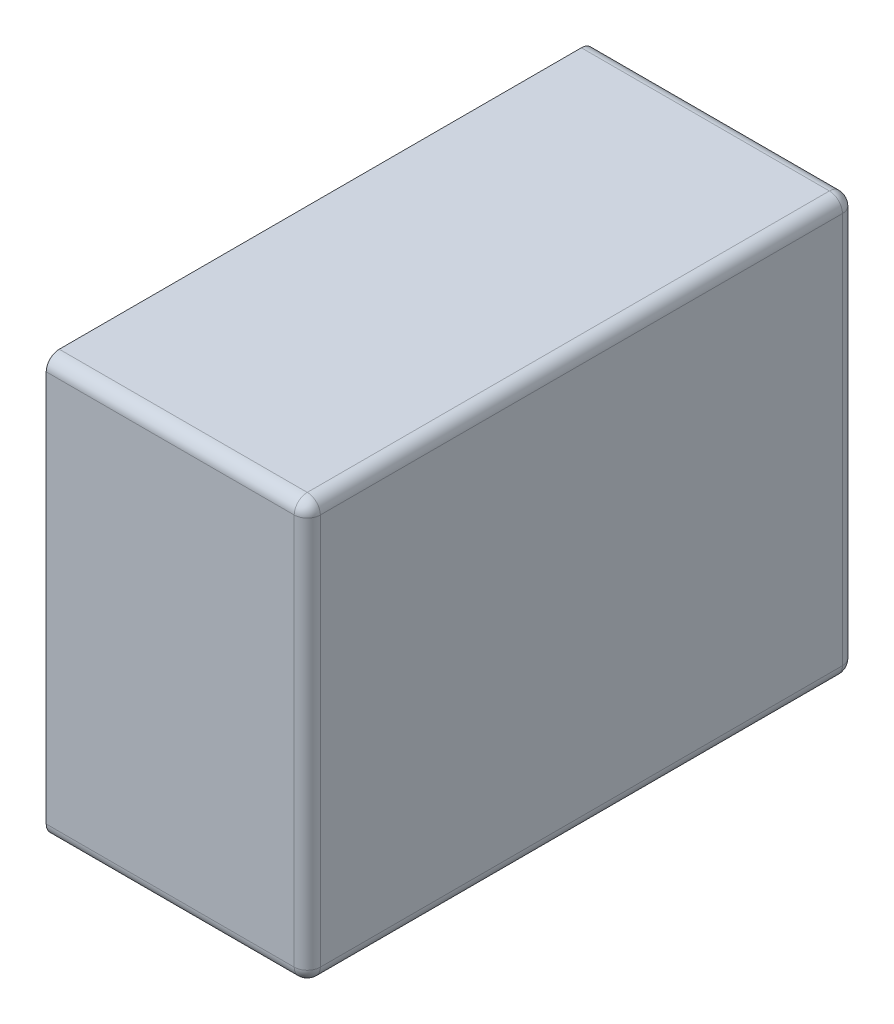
ISO-10303-21;
HEADER;
FILE_DESCRIPTION(('STEP AP214'),'2;1');
FILE_NAME('part.step','',(''),(''),'','','');
FILE_SCHEMA(('AUTOMOTIVE_DESIGN { 1 0 10303 214 1 1 1 1 }'));
ENDSEC;
DATA;
#1=APPLICATION_CONTEXT('core data for automotive mechanical design processes');
#2=APPLICATION_PROTOCOL_DEFINITION('international standard','automotive_design',2000,#1);
#3=PRODUCT_CONTEXT('',#1,'mechanical');
#4=PRODUCT('Part','Part','',(#3));
#5=PRODUCT_RELATED_PRODUCT_CATEGORY('part','',(#4));
#6=PRODUCT_DEFINITION_FORMATION('','',#4);
#7=PRODUCT_DEFINITION_CONTEXT('part definition',#1,'design');
#8=PRODUCT_DEFINITION('design','',#6,#7);
#9=PRODUCT_DEFINITION_SHAPE('','',#8);
#10=(LENGTH_UNIT() NAMED_UNIT(*) SI_UNIT(.MILLI.,.METRE.));
#11=(NAMED_UNIT(*) PLANE_ANGLE_UNIT() SI_UNIT($,.RADIAN.));
#12=(NAMED_UNIT(*) SI_UNIT($,.STERADIAN.) SOLID_ANGLE_UNIT());
#13=UNCERTAINTY_MEASURE_WITH_UNIT(LENGTH_MEASURE(1.E-05),#10,'distance_accuracy_value','');
#14=(GEOMETRIC_REPRESENTATION_CONTEXT(3) GLOBAL_UNCERTAINTY_ASSIGNED_CONTEXT((#13)) GLOBAL_UNIT_ASSIGNED_CONTEXT((#10,
#11,#12)) REPRESENTATION_CONTEXT('',''));
#15=CARTESIAN_POINT('',(0.,0.,0.));
#16=DIRECTION('',(0.,0.,1.));
#17=DIRECTION('',(1.,0.,0.));
#18=AXIS2_PLACEMENT_3D('',#15,#16,#17);
#19=CARTESIAN_POINT('',(0.,0.,0.));
#20=DIRECTION('',(1.,0.,0.));
#21=DIRECTION('',(0.,0.,-1.));
#22=AXIS2_PLACEMENT_3D('',#19,#20,#21);
#23=PLANE('',#22);
#24=DIRECTION('',(0.,0.,-1.));
#25=VECTOR('',#24,1.);
#26=CARTESIAN_POINT('',(0.,-48.,63.));
#27=LINE('',#26,#25);
#28=CARTESIAN_POINT('',(0.,-48.,60.));
#29=VERTEX_POINT('',#28);
#30=CARTESIAN_POINT('',(0.,-48.,-60.));
#31=VERTEX_POINT('',#30);
#32=EDGE_CURVE('E231',#29,#31,#27,.T.);
#33=ORIENTED_EDGE('',*,*,#32,.F.);
#34=CARTESIAN_POINT('',(0.,-45.,60.));
#35=DIRECTION('',(1.,0.,0.));
#36=DIRECTION('',(0.,0.,-1.));
#37=AXIS2_PLACEMENT_3D('',#34,#35,#36);
#38=CIRCLE('',#37,3.);
#39=CARTESIAN_POINT('',(0.,-45.,63.));
#40=VERTEX_POINT('',#39);
#41=EDGE_CURVE('E395',#29,#40,#38,.F.);
#42=ORIENTED_EDGE('',*,*,#41,.T.);
#43=DIRECTION('',(0.,-1.,0.));
#44=VECTOR('',#43,1.);
#45=CARTESIAN_POINT('',(0.,48.,63.));
#46=LINE('',#45,#44);
#47=CARTESIAN_POINT('',(0.,45.,63.));
#48=VERTEX_POINT('',#47);
#49=EDGE_CURVE('E281',#48,#40,#46,.T.);
#50=ORIENTED_EDGE('',*,*,#49,.F.);
#51=CARTESIAN_POINT('',(0.,45.,60.));
#52=DIRECTION('',(1.,0.,0.));
#53=DIRECTION('',(0.,0.,-1.));
#54=AXIS2_PLACEMENT_3D('',#51,#52,#53);
#55=CIRCLE('',#54,3.);
#56=CARTESIAN_POINT('',(0.,48.,60.));
#57=VERTEX_POINT('',#56);
#58=EDGE_CURVE('E393',#48,#57,#55,.F.);
#59=ORIENTED_EDGE('',*,*,#58,.T.);
#60=DIRECTION('',(0.,0.,1.));
#61=VECTOR('',#60,1.);
#62=CARTESIAN_POINT('',(0.,48.,63.));
#63=LINE('',#62,#61);
#64=CARTESIAN_POINT('',(0.,48.,-60.));
#65=VERTEX_POINT('',#64);
#66=EDGE_CURVE('E279',#65,#57,#63,.T.);
#67=ORIENTED_EDGE('',*,*,#66,.F.);
#68=CARTESIAN_POINT('',(0.,45.,-60.));
#69=DIRECTION('',(1.,0.,0.));
#70=DIRECTION('',(0.,0.,-1.));
#71=AXIS2_PLACEMENT_3D('',#68,#69,#70);
#72=CIRCLE('',#71,3.);
#73=CARTESIAN_POINT('',(0.,45.,-63.));
#74=VERTEX_POINT('',#73);
#75=EDGE_CURVE('E360',#65,#74,#72,.F.);
#76=ORIENTED_EDGE('',*,*,#75,.T.);
#77=DIRECTION('',(0.,1.,0.));
#78=VECTOR('',#77,1.);
#79=CARTESIAN_POINT('',(0.,48.,-63.));
#80=LINE('',#79,#78);
#81=CARTESIAN_POINT('',(0.,-45.,-63.));
#82=VERTEX_POINT('',#81);
#83=EDGE_CURVE('E266',#82,#74,#80,.T.);
#84=ORIENTED_EDGE('',*,*,#83,.F.);
#85=CARTESIAN_POINT('',(0.,-45.,-60.));
#86=DIRECTION('',(1.,0.,0.));
#87=DIRECTION('',(0.,0.,-1.));
#88=AXIS2_PLACEMENT_3D('',#85,#86,#87);
#89=CIRCLE('',#88,3.);
#90=EDGE_CURVE('E352',#82,#31,#89,.F.);
#91=ORIENTED_EDGE('',*,*,#90,.T.);
#92=EDGE_LOOP('',(#33,#42,#50,#59,#67,#76,#84,#91));
#93=FACE_BOUND('',#92,.T.);
#94=DIRECTION('',(0.,1.,0.));
#95=VECTOR('',#94,1.);
#96=CARTESIAN_POINT('',(0.,47.,62.));
#97=LINE('',#96,#95);
#98=CARTESIAN_POINT('',(0.,-41.,62.));
#99=VERTEX_POINT('',#98);
#100=CARTESIAN_POINT('',(0.,41.,62.));
#101=VERTEX_POINT('',#100);
#102=EDGE_CURVE('E267',#99,#101,#97,.T.);
#103=ORIENTED_EDGE('',*,*,#102,.F.);
#104=CARTESIAN_POINT('',(0.,-41.,56.));
#105=DIRECTION('',(1.,0.,0.));
#106=DIRECTION('',(0.,0.,-1.));
#107=AXIS2_PLACEMENT_3D('',#104,#105,#106);
#108=CIRCLE('',#107,6.);
#109=CARTESIAN_POINT('',(0.,-47.,56.));
#110=VERTEX_POINT('',#109);
#111=EDGE_CURVE('E294',#99,#110,#108,.T.);
#112=ORIENTED_EDGE('',*,*,#111,.T.);
#113=DIRECTION('',(0.,0.,1.));
#114=VECTOR('',#113,1.);
#115=CARTESIAN_POINT('',(0.,-47.,-62.));
#116=LINE('',#115,#114);
#117=CARTESIAN_POINT('',(0.,-47.,-56.));
#118=VERTEX_POINT('',#117);
#119=EDGE_CURVE('E258',#118,#110,#116,.T.);
#120=ORIENTED_EDGE('',*,*,#119,.F.);
#121=CARTESIAN_POINT('',(0.,-41.,-56.));
#122=DIRECTION('',(1.,0.,0.));
#123=DIRECTION('',(0.,0.,-1.));
#124=AXIS2_PLACEMENT_3D('',#121,#122,#123);
#125=CIRCLE('',#124,6.);
#126=CARTESIAN_POINT('',(0.,-41.,-62.));
#127=VERTEX_POINT('',#126);
#128=EDGE_CURVE('E348',#118,#127,#125,.T.);
#129=ORIENTED_EDGE('',*,*,#128,.T.);
#130=DIRECTION('',(0.,-1.,0.));
#131=VECTOR('',#130,1.);
#132=CARTESIAN_POINT('',(0.,47.,-62.));
#133=LINE('',#132,#131);
#134=CARTESIAN_POINT('',(0.,41.,-62.));
#135=VERTEX_POINT('',#134);
#136=EDGE_CURVE('E273',#135,#127,#133,.T.);
#137=ORIENTED_EDGE('',*,*,#136,.F.);
#138=CARTESIAN_POINT('',(0.,41.,-56.));
#139=DIRECTION('',(1.,0.,0.));
#140=DIRECTION('',(0.,0.,-1.));
#141=AXIS2_PLACEMENT_3D('',#138,#139,#140);
#142=CIRCLE('',#141,6.);
#143=CARTESIAN_POINT('',(0.,47.,-56.));
#144=VERTEX_POINT('',#143);
#145=EDGE_CURVE('E330',#135,#144,#142,.T.);
#146=ORIENTED_EDGE('',*,*,#145,.T.);
#147=DIRECTION('',(0.,0.,-1.));
#148=VECTOR('',#147,1.);
#149=CARTESIAN_POINT('',(0.,47.,-62.));
#150=LINE('',#149,#148);
#151=CARTESIAN_POINT('',(0.,47.,56.));
#152=VERTEX_POINT('',#151);
#153=EDGE_CURVE('E270',#152,#144,#150,.T.);
#154=ORIENTED_EDGE('',*,*,#153,.F.);
#155=CARTESIAN_POINT('',(0.,41.,56.));
#156=DIRECTION('',(1.,0.,0.));
#157=DIRECTION('',(0.,0.,-1.));
#158=AXIS2_PLACEMENT_3D('',#155,#156,#157);
#159=CIRCLE('',#158,6.);
#160=EDGE_CURVE('E312',#152,#101,#159,.T.);
#161=ORIENTED_EDGE('',*,*,#160,.T.);
#162=EDGE_LOOP('',(#103,#112,#120,#129,#137,#146,#154,#161));
#163=FACE_BOUND('',#162,.T.);
#164=ADVANCED_FACE('F35',(#93,#163),#23,.F.);
#165=CARTESIAN_POINT('',(60.,48.,-63.));
#166=DIRECTION('',(0.,0.,1.));
#167=DIRECTION('',(0.,-1.,0.));
#168=AXIS2_PLACEMENT_3D('',#165,#166,#167);
#169=PLANE('',#168);
#170=CARTESIAN_POINT('',(20.5,20.,-63.));
#171=DIRECTION('',(0.,0.,1.));
#172=DIRECTION('',(1.,0.,0.));
#173=AXIS2_PLACEMENT_3D('',#170,#171,#172);
#174=CIRCLE('',#173,6.);
#175=CARTESIAN_POINT('',(26.5,20.,-63.));
#176=VERTEX_POINT('',#175);
#177=EDGE_CURVE('E555',#176,#176,#174,.T.);
#178=ORIENTED_EDGE('',*,*,#177,.T.);
#179=EDGE_LOOP('',(#178));
#180=FACE_BOUND('',#179,.T.);
#181=CARTESIAN_POINT('',(20.5,0.,-63.));
#182=DIRECTION('',(0.,0.,1.));
#183=DIRECTION('',(1.,0.,0.));
#184=AXIS2_PLACEMENT_3D('',#181,#182,#183);
#185=CIRCLE('',#184,6.);
#186=CARTESIAN_POINT('',(26.5,0.,-63.));
#187=VERTEX_POINT('',#186);
#188=EDGE_CURVE('E563',#187,#187,#185,.T.);
#189=ORIENTED_EDGE('',*,*,#188,.T.);
#190=EDGE_LOOP('',(#189));
#191=FACE_BOUND('',#190,.T.);
#192=CARTESIAN_POINT('',(20.5,-20.,-63.));
#193=DIRECTION('',(0.,0.,1.));
#194=DIRECTION('',(1.,0.,0.));
#195=AXIS2_PLACEMENT_3D('',#192,#193,#194);
#196=CIRCLE('',#195,3.5);
#197=CARTESIAN_POINT('',(24.,-20.,-63.));
#198=VERTEX_POINT('',#197);
#199=EDGE_CURVE('E412',#198,#198,#196,.T.);
#200=ORIENTED_EDGE('',*,*,#199,.T.);
#201=EDGE_LOOP('',(#200));
#202=FACE_BOUND('',#201,.T.);
#203=DIRECTION('',(-1.,0.,0.));
#204=VECTOR('',#203,1.);
#205=CARTESIAN_POINT('',(60.,45.,-63.));
#206=LINE('',#205,#204);
#207=CARTESIAN_POINT('',(57.,45.,-63.));
#208=VERTEX_POINT('',#207);
#209=EDGE_CURVE('E362',#74,#208,#206,.F.);
#210=ORIENTED_EDGE('',*,*,#209,.T.);
#211=DIRECTION('',(0.,1.,0.));
#212=VECTOR('',#211,1.);
#213=CARTESIAN_POINT('',(57.,-45.,-63.));
#214=LINE('',#213,#212);
#215=CARTESIAN_POINT('',(57.,-45.,-63.));
#216=VERTEX_POINT('',#215);
#217=EDGE_CURVE('E376',#208,#216,#214,.F.);
#218=ORIENTED_EDGE('',*,*,#217,.T.);
#219=DIRECTION('',(-1.,0.,0.));
#220=VECTOR('',#219,1.);
#221=CARTESIAN_POINT('',(60.,-45.,-63.));
#222=LINE('',#221,#220);
#223=EDGE_CURVE('E350',#216,#82,#222,.T.);
#224=ORIENTED_EDGE('',*,*,#223,.T.);
#225=ORIENTED_EDGE('',*,*,#83,.T.);
#226=EDGE_LOOP('',(#210,#218,#224,#225));
#227=FACE_BOUND('',#226,.T.);
#228=ADVANCED_FACE('F474',(#180,#191,#202,#227),#169,.F.);
#229=CARTESIAN_POINT('',(60.,48.,63.));
#230=DIRECTION('',(0.,-1.,0.));
#231=DIRECTION('',(0.,0.,-1.));
#232=AXIS2_PLACEMENT_3D('',#229,#230,#231);
#233=PLANE('',#232);
#234=ORIENTED_EDGE('',*,*,#66,.T.);
#235=DIRECTION('',(-1.,0.,0.));
#236=VECTOR('',#235,1.);
#237=CARTESIAN_POINT('',(60.,48.,60.));
#238=LINE('',#237,#236);
#239=CARTESIAN_POINT('',(57.,48.,60.));
#240=VERTEX_POINT('',#239);
#241=EDGE_CURVE('E11',#57,#240,#238,.F.);
#242=ORIENTED_EDGE('',*,*,#241,.T.);
#243=DIRECTION('',(0.,0.,1.));
#244=VECTOR('',#243,1.);
#245=CARTESIAN_POINT('',(57.,48.,-60.));
#246=LINE('',#245,#244);
#247=CARTESIAN_POINT('',(57.,48.,-60.));
#248=VERTEX_POINT('',#247);
#249=EDGE_CURVE('E380',#240,#248,#246,.F.);
#250=ORIENTED_EDGE('',*,*,#249,.T.);
#251=DIRECTION('',(-1.,0.,0.));
#252=VECTOR('',#251,1.);
#253=CARTESIAN_POINT('',(60.,48.,-60.));
#254=LINE('',#253,#252);
#255=EDGE_CURVE('E358',#248,#65,#254,.T.);
#256=ORIENTED_EDGE('',*,*,#255,.T.);
#257=EDGE_LOOP('',(#234,#242,#250,#256));
#258=FACE_BOUND('',#257,.T.);
#259=ADVANCED_FACE('F478',(#258),#233,.F.);
#260=CARTESIAN_POINT('',(60.,48.,63.));
#261=DIRECTION('',(0.,0.,-1.));
#262=DIRECTION('',(0.,1.,0.));
#263=AXIS2_PLACEMENT_3D('',#260,#261,#262);
#264=PLANE('',#263);
#265=ORIENTED_EDGE('',*,*,#49,.T.);
#266=DIRECTION('',(-1.,0.,0.));
#267=VECTOR('',#266,1.);
#268=CARTESIAN_POINT('',(60.,-45.,63.));
#269=LINE('',#268,#267);
#270=CARTESIAN_POINT('',(57.,-45.,63.));
#271=VERTEX_POINT('',#270);
#272=EDGE_CURVE('E401',#40,#271,#269,.F.);
#273=ORIENTED_EDGE('',*,*,#272,.T.);
#274=DIRECTION('',(0.,-1.,0.));
#275=VECTOR('',#274,1.);
#276=CARTESIAN_POINT('',(57.,45.,63.));
#277=LINE('',#276,#275);
#278=CARTESIAN_POINT('',(57.,45.,63.));
#279=VERTEX_POINT('',#278);
#280=EDGE_CURVE('E399',#271,#279,#277,.F.);
#281=ORIENTED_EDGE('',*,*,#280,.T.);
#282=DIRECTION('',(-1.,0.,0.));
#283=VECTOR('',#282,1.);
#284=CARTESIAN_POINT('',(60.,45.,63.));
#285=LINE('',#284,#283);
#286=EDGE_CURVE('E397',#279,#48,#285,.T.);
#287=ORIENTED_EDGE('',*,*,#286,.T.);
#288=EDGE_LOOP('',(#265,#273,#281,#287));
#289=FACE_BOUND('',#288,.T.);
#290=ADVANCED_FACE('F429',(#289),#264,.F.);
#291=CARTESIAN_POINT('',(60.,-48.,63.));
#292=DIRECTION('',(0.,1.,0.));
#293=DIRECTION('',(0.,0.,1.));
#294=AXIS2_PLACEMENT_3D('',#291,#292,#293);
#295=PLANE('',#294);
#296=DIRECTION('',(0.,0.,-1.));
#297=VECTOR('',#296,1.);
#298=CARTESIAN_POINT('',(57.,-48.,63.));
#299=LINE('',#298,#297);
#300=CARTESIAN_POINT('',(57.,-48.,-60.));
#301=VERTEX_POINT('',#300);
#302=CARTESIAN_POINT('',(57.,-48.,60.));
#303=VERTEX_POINT('',#302);
#304=EDGE_CURVE('E371',#301,#303,#299,.F.);
#305=ORIENTED_EDGE('',*,*,#304,.T.);
#306=DIRECTION('',(-1.,0.,0.));
#307=VECTOR('',#306,1.);
#308=CARTESIAN_POINT('',(60.,-48.,60.));
#309=LINE('',#308,#307);
#310=EDGE_CURVE('E382',#303,#29,#309,.T.);
#311=ORIENTED_EDGE('',*,*,#310,.T.);
#312=ORIENTED_EDGE('',*,*,#32,.T.);
#313=DIRECTION('',(-1.,0.,0.));
#314=VECTOR('',#313,1.);
#315=CARTESIAN_POINT('',(60.,-48.,-60.));
#316=LINE('',#315,#314);
#317=EDGE_CURVE('E355',#31,#301,#316,.F.);
#318=ORIENTED_EDGE('',*,*,#317,.T.);
#319=EDGE_LOOP('',(#305,#311,#312,#318));
#320=FACE_BOUND('',#319,.T.);
#321=ADVANCED_FACE('F439',(#320),#295,.F.);
#322=CARTESIAN_POINT('',(60.,0.,0.));
#323=DIRECTION('',(1.,0.,0.));
#324=DIRECTION('',(0.,0.,-1.));
#325=AXIS2_PLACEMENT_3D('',#322,#323,#324);
#326=PLANE('',#325);
#327=DIRECTION('',(0.,0.,1.));
#328=VECTOR('',#327,1.);
#329=CARTESIAN_POINT('',(60.,45.,63.));
#330=LINE('',#329,#328);
#331=CARTESIAN_POINT('',(60.,45.,-60.));
#332=VERTEX_POINT('',#331);
#333=CARTESIAN_POINT('',(60.,45.,60.));
#334=VERTEX_POINT('',#333);
#335=EDGE_CURVE('E365',#332,#334,#330,.T.);
#336=ORIENTED_EDGE('',*,*,#335,.T.);
#337=DIRECTION('',(0.,-1.,0.));
#338=VECTOR('',#337,1.);
#339=CARTESIAN_POINT('',(60.,-45.,60.));
#340=LINE('',#339,#338);
#341=CARTESIAN_POINT('',(60.,-45.,60.));
#342=VERTEX_POINT('',#341);
#343=EDGE_CURVE('E405',#334,#342,#340,.T.);
#344=ORIENTED_EDGE('',*,*,#343,.T.);
#345=DIRECTION('',(0.,0.,-1.));
#346=VECTOR('',#345,1.);
#347=CARTESIAN_POINT('',(60.,-45.,-60.));
#348=LINE('',#347,#346);
#349=CARTESIAN_POINT('',(60.,-45.,-60.));
#350=VERTEX_POINT('',#349);
#351=EDGE_CURVE('E369',#342,#350,#348,.T.);
#352=ORIENTED_EDGE('',*,*,#351,.T.);
#353=DIRECTION('',(0.,1.,0.));
#354=VECTOR('',#353,1.);
#355=CARTESIAN_POINT('',(60.,45.,-60.));
#356=LINE('',#355,#354);
#357=EDGE_CURVE('E367',#350,#332,#356,.T.);
#358=ORIENTED_EDGE('',*,*,#357,.T.);
#359=EDGE_LOOP('',(#336,#344,#352,#358));
#360=FACE_BOUND('',#359,.T.);
#361=ADVANCED_FACE('F452',(#360),#326,.T.);
#362=CARTESIAN_POINT('',(-1.,47.,62.));
#363=DIRECTION('',(0.,0.,-1.));
#364=DIRECTION('',(-1.,0.,0.));
#365=AXIS2_PLACEMENT_3D('',#362,#363,#364);
#366=PLANE('',#365);
#367=ORIENTED_EDGE('',*,*,#102,.T.);
#368=DIRECTION('',(1.,0.,0.));
#369=VECTOR('',#368,1.);
#370=CARTESIAN_POINT('',(-1.,41.,62.));
#371=LINE('',#370,#369);
#372=CARTESIAN_POINT('',(-1.,41.,62.));
#373=VERTEX_POINT('',#372);
#374=EDGE_CURVE('E308',#101,#373,#371,.F.);
#375=ORIENTED_EDGE('',*,*,#374,.T.);
#376=DIRECTION('',(0.,1.,0.));
#377=VECTOR('',#376,1.);
#378=CARTESIAN_POINT('',(-1.,47.,62.));
#379=LINE('',#378,#377);
#380=CARTESIAN_POINT('',(-1.,-41.,62.));
#381=VERTEX_POINT('',#380);
#382=EDGE_CURVE('E254',#381,#373,#379,.T.);
#383=ORIENTED_EDGE('',*,*,#382,.F.);
#384=DIRECTION('',(1.,0.,0.));
#385=VECTOR('',#384,1.);
#386=CARTESIAN_POINT('',(-1.,-41.,62.));
#387=LINE('',#386,#385);
#388=EDGE_CURVE('E220',#381,#99,#387,.T.);
#389=ORIENTED_EDGE('',*,*,#388,.T.);
#390=EDGE_LOOP('',(#367,#375,#383,#389));
#391=FACE_BOUND('',#390,.T.);
#392=ADVANCED_FACE('F499',(#391),#366,.F.);
#393=CARTESIAN_POINT('',(-1.,47.,-62.));
#394=DIRECTION('',(0.,-1.,0.));
#395=DIRECTION('',(0.,0.,-1.));
#396=AXIS2_PLACEMENT_3D('',#393,#394,#395);
#397=PLANE('',#396);
#398=ORIENTED_EDGE('',*,*,#153,.T.);
#399=DIRECTION('',(1.,0.,0.));
#400=VECTOR('',#399,1.);
#401=CARTESIAN_POINT('',(-1.,47.,-56.));
#402=LINE('',#401,#400);
#403=CARTESIAN_POINT('',(-1.,47.,-56.));
#404=VERTEX_POINT('',#403);
#405=EDGE_CURVE('E326',#144,#404,#402,.F.);
#406=ORIENTED_EDGE('',*,*,#405,.T.);
#407=DIRECTION('',(0.,0.,-1.));
#408=VECTOR('',#407,1.);
#409=CARTESIAN_POINT('',(-1.,47.,-62.));
#410=LINE('',#409,#408);
#411=CARTESIAN_POINT('',(-1.,47.,56.));
#412=VERTEX_POINT('',#411);
#413=EDGE_CURVE('E257',#412,#404,#410,.T.);
#414=ORIENTED_EDGE('',*,*,#413,.F.);
#415=DIRECTION('',(1.,0.,0.));
#416=VECTOR('',#415,1.);
#417=CARTESIAN_POINT('',(-1.,47.,56.));
#418=LINE('',#417,#416);
#419=EDGE_CURVE('E305',#412,#152,#418,.T.);
#420=ORIENTED_EDGE('',*,*,#419,.T.);
#421=EDGE_LOOP('',(#398,#406,#414,#420));
#422=FACE_BOUND('',#421,.T.);
#423=ADVANCED_FACE('F503',(#422),#397,.F.);
#424=CARTESIAN_POINT('',(-1.,47.,-62.));
#425=DIRECTION('',(0.,0.,1.));
#426=DIRECTION('',(1.,0.,0.));
#427=AXIS2_PLACEMENT_3D('',#424,#425,#426);
#428=PLANE('',#427);
#429=ORIENTED_EDGE('',*,*,#136,.T.);
#430=DIRECTION('',(1.,0.,0.));
#431=VECTOR('',#430,1.);
#432=CARTESIAN_POINT('',(-1.,-41.,-62.));
#433=LINE('',#432,#431);
#434=CARTESIAN_POINT('',(-1.,-41.,-62.));
#435=VERTEX_POINT('',#434);
#436=EDGE_CURVE('E344',#127,#435,#433,.F.);
#437=ORIENTED_EDGE('',*,*,#436,.T.);
#438=DIRECTION('',(0.,-1.,0.));
#439=VECTOR('',#438,1.);
#440=CARTESIAN_POINT('',(-1.,47.,-62.));
#441=LINE('',#440,#439);
#442=CARTESIAN_POINT('',(-1.,41.,-62.));
#443=VERTEX_POINT('',#442);
#444=EDGE_CURVE('E261',#443,#435,#441,.T.);
#445=ORIENTED_EDGE('',*,*,#444,.F.);
#446=DIRECTION('',(1.,0.,0.));
#447=VECTOR('',#446,1.);
#448=CARTESIAN_POINT('',(-1.,41.,-62.));
#449=LINE('',#448,#447);
#450=EDGE_CURVE('E323',#443,#135,#449,.T.);
#451=ORIENTED_EDGE('',*,*,#450,.T.);
#452=EDGE_LOOP('',(#429,#437,#445,#451));
#453=FACE_BOUND('',#452,.T.);
#454=ADVANCED_FACE('F508',(#453),#428,.F.);
#455=CARTESIAN_POINT('',(-1.,-47.,-62.));
#456=DIRECTION('',(0.,1.,0.));
#457=DIRECTION('',(0.,0.,1.));
#458=AXIS2_PLACEMENT_3D('',#455,#456,#457);
#459=PLANE('',#458);
#460=DIRECTION('',(0.,0.,1.));
#461=VECTOR('',#460,1.);
#462=CARTESIAN_POINT('',(-1.,-47.,-62.));
#463=LINE('',#462,#461);
#464=CARTESIAN_POINT('',(-1.,-47.,-56.));
#465=VERTEX_POINT('',#464);
#466=CARTESIAN_POINT('',(-1.,-47.,56.));
#467=VERTEX_POINT('',#466);
#468=EDGE_CURVE('E264',#465,#467,#463,.T.);
#469=ORIENTED_EDGE('',*,*,#468,.F.);
#470=DIRECTION('',(1.,0.,0.));
#471=VECTOR('',#470,1.);
#472=CARTESIAN_POINT('',(-1.,-47.,-56.));
#473=LINE('',#472,#471);
#474=EDGE_CURVE('E341',#465,#118,#473,.T.);
#475=ORIENTED_EDGE('',*,*,#474,.T.);
#476=ORIENTED_EDGE('',*,*,#119,.T.);
#477=DIRECTION('',(1.,0.,0.));
#478=VECTOR('',#477,1.);
#479=CARTESIAN_POINT('',(-1.,-47.,56.));
#480=LINE('',#479,#478);
#481=EDGE_CURVE('E289',#110,#467,#480,.F.);
#482=ORIENTED_EDGE('',*,*,#481,.T.);
#483=EDGE_LOOP('',(#469,#475,#476,#482));
#484=FACE_BOUND('',#483,.T.);
#485=ADVANCED_FACE('F514',(#484),#459,.F.);
#486=CARTESIAN_POINT('',(-1.,0.,0.));
#487=DIRECTION('',(-1.,0.,0.));
#488=DIRECTION('',(0.,0.,1.));
#489=AXIS2_PLACEMENT_3D('',#486,#487,#488);
#490=PLANE('',#489);
#491=DIRECTION('',(0.,1.,0.));
#492=VECTOR('',#491,1.);
#493=CARTESIAN_POINT('',(-1.,46.,61.));
#494=LINE('',#493,#492);
#495=CARTESIAN_POINT('',(-1.,-40.,61.));
#496=VERTEX_POINT('',#495);
#497=CARTESIAN_POINT('',(-1.,40.,61.));
#498=VERTEX_POINT('',#497);
#499=EDGE_CURVE('E227',#496,#498,#494,.T.);
#500=ORIENTED_EDGE('',*,*,#499,.F.);
#501=CARTESIAN_POINT('',(-1.,-40.,55.));
#502=DIRECTION('',(-1.,0.,0.));
#503=DIRECTION('',(0.,0.,1.));
#504=AXIS2_PLACEMENT_3D('',#501,#502,#503);
#505=CIRCLE('',#504,6.);
#506=CARTESIAN_POINT('',(-1.,-46.,55.));
#507=VERTEX_POINT('',#506);
#508=EDGE_CURVE('E210',#496,#507,#505,.F.);
#509=ORIENTED_EDGE('',*,*,#508,.T.);
#510=DIRECTION('',(0.,0.,1.));
#511=VECTOR('',#510,1.);
#512=CARTESIAN_POINT('',(-1.,-46.,-61.));
#513=LINE('',#512,#511);
#514=CARTESIAN_POINT('',(-1.,-46.,-55.));
#515=VERTEX_POINT('',#514);
#516=EDGE_CURVE('E252',#515,#507,#513,.T.);
#517=ORIENTED_EDGE('',*,*,#516,.F.);
#518=CARTESIAN_POINT('',(-1.,-40.,-55.));
#519=DIRECTION('',(-1.,0.,0.));
#520=DIRECTION('',(0.,0.,1.));
#521=AXIS2_PLACEMENT_3D('',#518,#519,#520);
#522=CIRCLE('',#521,6.);
#523=CARTESIAN_POINT('',(-1.,-40.,-61.));
#524=VERTEX_POINT('',#523);
#525=EDGE_CURVE('E339',#515,#524,#522,.F.);
#526=ORIENTED_EDGE('',*,*,#525,.T.);
#527=DIRECTION('',(0.,-1.,0.));
#528=VECTOR('',#527,1.);
#529=CARTESIAN_POINT('',(-1.,46.,-61.));
#530=LINE('',#529,#528);
#531=CARTESIAN_POINT('',(-1.,40.,-61.));
#532=VERTEX_POINT('',#531);
#533=EDGE_CURVE('E241',#532,#524,#530,.T.);
#534=ORIENTED_EDGE('',*,*,#533,.F.);
#535=CARTESIAN_POINT('',(-1.,40.,-55.));
#536=DIRECTION('',(-1.,0.,0.));
#537=DIRECTION('',(0.,0.,1.));
#538=AXIS2_PLACEMENT_3D('',#535,#536,#537);
#539=CIRCLE('',#538,6.);
#540=CARTESIAN_POINT('',(-1.,46.,-55.));
#541=VERTEX_POINT('',#540);
#542=EDGE_CURVE('E321',#532,#541,#539,.F.);
#543=ORIENTED_EDGE('',*,*,#542,.T.);
#544=DIRECTION('',(0.,0.,-1.));
#545=VECTOR('',#544,1.);
#546=CARTESIAN_POINT('',(-1.,46.,-61.));
#547=LINE('',#546,#545);
#548=CARTESIAN_POINT('',(-1.,46.,55.));
#549=VERTEX_POINT('',#548);
#550=EDGE_CURVE('E237',#549,#541,#547,.T.);
#551=ORIENTED_EDGE('',*,*,#550,.F.);
#552=CARTESIAN_POINT('',(-1.,40.,55.));
#553=DIRECTION('',(-1.,0.,0.));
#554=DIRECTION('',(0.,0.,1.));
#555=AXIS2_PLACEMENT_3D('',#552,#553,#554);
#556=CIRCLE('',#555,6.);
#557=EDGE_CURVE('E236',#549,#498,#556,.F.);
#558=ORIENTED_EDGE('',*,*,#557,.T.);
#559=EDGE_LOOP('',(#500,#509,#517,#526,#534,#543,#551,#558));
#560=FACE_BOUND('',#559,.T.);
#561=ORIENTED_EDGE('',*,*,#444,.T.);
#562=CARTESIAN_POINT('',(-1.,-41.,-56.));
#563=DIRECTION('',(-1.,0.,0.));
#564=DIRECTION('',(0.,0.,1.));
#565=AXIS2_PLACEMENT_3D('',#562,#563,#564);
#566=CIRCLE('',#565,6.);
#567=EDGE_CURVE('E346',#435,#465,#566,.T.);
#568=ORIENTED_EDGE('',*,*,#567,.T.);
#569=ORIENTED_EDGE('',*,*,#468,.T.);
#570=CARTESIAN_POINT('',(-1.,-41.,56.));
#571=DIRECTION('',(-1.,0.,0.));
#572=DIRECTION('',(0.,0.,1.));
#573=AXIS2_PLACEMENT_3D('',#570,#571,#572);
#574=CIRCLE('',#573,6.);
#575=EDGE_CURVE('E292',#467,#381,#574,.T.);
#576=ORIENTED_EDGE('',*,*,#575,.T.);
#577=ORIENTED_EDGE('',*,*,#382,.T.);
#578=CARTESIAN_POINT('',(-1.,41.,56.));
#579=DIRECTION('',(-1.,0.,0.));
#580=DIRECTION('',(0.,0.,1.));
#581=AXIS2_PLACEMENT_3D('',#578,#579,#580);
#582=CIRCLE('',#581,6.);
#583=EDGE_CURVE('E310',#373,#412,#582,.T.);
#584=ORIENTED_EDGE('',*,*,#583,.T.);
#585=ORIENTED_EDGE('',*,*,#413,.T.);
#586=CARTESIAN_POINT('',(-1.,41.,-56.));
#587=DIRECTION('',(-1.,0.,0.));
#588=DIRECTION('',(0.,0.,1.));
#589=AXIS2_PLACEMENT_3D('',#586,#587,#588);
#590=CIRCLE('',#589,6.);
#591=EDGE_CURVE('E328',#404,#443,#590,.T.);
#592=ORIENTED_EDGE('',*,*,#591,.T.);
#593=EDGE_LOOP('',(#561,#568,#569,#576,#577,#584,#585,#592));
#594=FACE_BOUND('',#593,.T.);
#595=ADVANCED_FACE('F233',(#560,#594),#490,.T.);
#596=CARTESIAN_POINT('',(54.,46.,61.));
#597=DIRECTION('',(0.,0.,1.));
#598=DIRECTION('',(1.,0.,0.));
#599=AXIS2_PLACEMENT_3D('',#596,#597,#598);
#600=PLANE('',#599);
#601=ORIENTED_EDGE('',*,*,#499,.T.);
#602=DIRECTION('',(-1.,0.,0.));
#603=VECTOR('',#602,1.);
#604=CARTESIAN_POINT('',(54.,40.,61.));
#605=LINE('',#604,#603);
#606=CARTESIAN_POINT('',(54.,40.,61.));
#607=VERTEX_POINT('',#606);
#608=EDGE_CURVE('E300',#498,#607,#605,.F.);
#609=ORIENTED_EDGE('',*,*,#608,.T.);
#610=DIRECTION('',(0.,1.,0.));
#611=VECTOR('',#610,1.);
#612=CARTESIAN_POINT('',(54.,46.,61.));
#613=LINE('',#612,#611);
#614=CARTESIAN_POINT('',(54.,-40.,61.));
#615=VERTEX_POINT('',#614);
#616=EDGE_CURVE('E230',#615,#607,#613,.T.);
#617=ORIENTED_EDGE('',*,*,#616,.F.);
#618=DIRECTION('',(-1.,0.,0.));
#619=VECTOR('',#618,1.);
#620=CARTESIAN_POINT('',(-1.,-40.,61.));
#621=LINE('',#620,#619);
#622=EDGE_CURVE('E214',#615,#496,#621,.T.);
#623=ORIENTED_EDGE('',*,*,#622,.T.);
#624=EDGE_LOOP('',(#601,#609,#617,#623));
#625=FACE_BOUND('',#624,.T.);
#626=ADVANCED_FACE('F226',(#625),#600,.F.);
#627=CARTESIAN_POINT('',(54.,-46.,-61.));
#628=DIRECTION('',(0.,-1.,0.));
#629=DIRECTION('',(0.,0.,-1.));
#630=AXIS2_PLACEMENT_3D('',#627,#628,#629);
#631=PLANE('',#630);
#632=DIRECTION('',(0.,0.,1.));
#633=VECTOR('',#632,1.);
#634=CARTESIAN_POINT('',(54.,-46.,-61.));
#635=LINE('',#634,#633);
#636=CARTESIAN_POINT('',(54.,-46.,-55.));
#637=VERTEX_POINT('',#636);
#638=CARTESIAN_POINT('',(54.,-46.,55.));
#639=VERTEX_POINT('',#638);
#640=EDGE_CURVE('E247',#637,#639,#635,.T.);
#641=ORIENTED_EDGE('',*,*,#640,.F.);
#642=DIRECTION('',(-1.,0.,0.));
#643=VECTOR('',#642,1.);
#644=CARTESIAN_POINT('',(-1.,-46.,-55.));
#645=LINE('',#644,#643);
#646=EDGE_CURVE('E332',#637,#515,#645,.T.);
#647=ORIENTED_EDGE('',*,*,#646,.T.);
#648=ORIENTED_EDGE('',*,*,#516,.T.);
#649=DIRECTION('',(-1.,0.,0.));
#650=VECTOR('',#649,1.);
#651=CARTESIAN_POINT('',(54.,-46.,55.));
#652=LINE('',#651,#650);
#653=EDGE_CURVE('E216',#507,#639,#652,.F.);
#654=ORIENTED_EDGE('',*,*,#653,.T.);
#655=EDGE_LOOP('',(#641,#647,#648,#654));
#656=FACE_BOUND('',#655,.T.);
#657=ADVANCED_FACE('F523',(#656),#631,.F.);
#658=CARTESIAN_POINT('',(54.,46.,-61.));
#659=DIRECTION('',(0.,0.,-1.));
#660=DIRECTION('',(-1.,0.,0.));
#661=AXIS2_PLACEMENT_3D('',#658,#659,#660);
#662=PLANE('',#661);
#663=CARTESIAN_POINT('',(20.5,20.,-61.));
#664=DIRECTION('',(0.,0.,1.));
#665=DIRECTION('',(1.,0.,0.));
#666=AXIS2_PLACEMENT_3D('',#663,#664,#665);
#667=CIRCLE('',#666,6.);
#668=CARTESIAN_POINT('',(26.5,20.,-61.));
#669=VERTEX_POINT('',#668);
#670=EDGE_CURVE('E558',#669,#669,#667,.T.);
#671=ORIENTED_EDGE('',*,*,#670,.F.);
#672=EDGE_LOOP('',(#671));
#673=FACE_BOUND('',#672,.T.);
#674=CARTESIAN_POINT('',(20.5,0.,-61.));
#675=DIRECTION('',(0.,0.,1.));
#676=DIRECTION('',(1.,0.,0.));
#677=AXIS2_PLACEMENT_3D('',#674,#675,#676);
#678=CIRCLE('',#677,6.);
#679=CARTESIAN_POINT('',(26.5,0.,-61.));
#680=VERTEX_POINT('',#679);
#681=EDGE_CURVE('E560',#680,#680,#678,.T.);
#682=ORIENTED_EDGE('',*,*,#681,.F.);
#683=EDGE_LOOP('',(#682));
#684=FACE_BOUND('',#683,.T.);
#685=CARTESIAN_POINT('',(20.5,-20.,-61.));
#686=DIRECTION('',(0.,0.,1.));
#687=DIRECTION('',(1.,0.,0.));
#688=AXIS2_PLACEMENT_3D('',#685,#686,#687);
#689=CIRCLE('',#688,3.5);
#690=CARTESIAN_POINT('',(24.,-20.,-61.));
#691=VERTEX_POINT('',#690);
#692=EDGE_CURVE('E566',#691,#691,#689,.T.);
#693=ORIENTED_EDGE('',*,*,#692,.F.);
#694=EDGE_LOOP('',(#693));
#695=FACE_BOUND('',#694,.T.);
#696=ORIENTED_EDGE('',*,*,#533,.T.);
#697=DIRECTION('',(-1.,0.,0.));
#698=VECTOR('',#697,1.);
#699=CARTESIAN_POINT('',(54.,-40.,-61.));
#700=LINE('',#699,#698);
#701=CARTESIAN_POINT('',(54.,-40.,-61.));
#702=VERTEX_POINT('',#701);
#703=EDGE_CURVE('E335',#524,#702,#700,.F.);
#704=ORIENTED_EDGE('',*,*,#703,.T.);
#705=DIRECTION('',(0.,-1.,0.));
#706=VECTOR('',#705,1.);
#707=CARTESIAN_POINT('',(54.,46.,-61.));
#708=LINE('',#707,#706);
#709=CARTESIAN_POINT('',(54.,40.,-61.));
#710=VERTEX_POINT('',#709);
#711=EDGE_CURVE('E576',#710,#702,#708,.T.);
#712=ORIENTED_EDGE('',*,*,#711,.F.);
#713=DIRECTION('',(-1.,0.,0.));
#714=VECTOR('',#713,1.);
#715=CARTESIAN_POINT('',(-1.,40.,-61.));
#716=LINE('',#715,#714);
#717=EDGE_CURVE('E314',#710,#532,#716,.T.);
#718=ORIENTED_EDGE('',*,*,#717,.T.);
#719=EDGE_LOOP('',(#696,#704,#712,#718));
#720=FACE_BOUND('',#719,.T.);
#721=ADVANCED_FACE('F528',(#673,#684,#695,#720),#662,.F.);
#722=CARTESIAN_POINT('',(54.,46.,-61.));
#723=DIRECTION('',(0.,1.,0.));
#724=DIRECTION('',(0.,0.,1.));
#725=AXIS2_PLACEMENT_3D('',#722,#723,#724);
#726=PLANE('',#725);
#727=ORIENTED_EDGE('',*,*,#550,.T.);
#728=DIRECTION('',(-1.,0.,0.));
#729=VECTOR('',#728,1.);
#730=CARTESIAN_POINT('',(54.,46.,-55.));
#731=LINE('',#730,#729);
#732=CARTESIAN_POINT('',(54.,46.,-55.));
#733=VERTEX_POINT('',#732);
#734=EDGE_CURVE('E317',#541,#733,#731,.F.);
#735=ORIENTED_EDGE('',*,*,#734,.T.);
#736=DIRECTION('',(0.,0.,-1.));
#737=VECTOR('',#736,1.);
#738=CARTESIAN_POINT('',(54.,46.,-61.));
#739=LINE('',#738,#737);
#740=CARTESIAN_POINT('',(54.,46.,55.));
#741=VERTEX_POINT('',#740);
#742=EDGE_CURVE('E574',#741,#733,#739,.T.);
#743=ORIENTED_EDGE('',*,*,#742,.F.);
#744=DIRECTION('',(-1.,0.,0.));
#745=VECTOR('',#744,1.);
#746=CARTESIAN_POINT('',(-1.,46.,55.));
#747=LINE('',#746,#745);
#748=EDGE_CURVE('E297',#741,#549,#747,.T.);
#749=ORIENTED_EDGE('',*,*,#748,.T.);
#750=EDGE_LOOP('',(#727,#735,#743,#749));
#751=FACE_BOUND('',#750,.T.);
#752=ADVANCED_FACE('F524',(#751),#726,.F.);
#753=CARTESIAN_POINT('',(54.,0.,0.));
#754=DIRECTION('',(-1.,0.,0.));
#755=DIRECTION('',(0.,0.,1.));
#756=AXIS2_PLACEMENT_3D('',#753,#754,#755);
#757=PLANE('',#756);
#758=ORIENTED_EDGE('',*,*,#711,.T.);
#759=CARTESIAN_POINT('',(54.,-40.,-55.));
#760=DIRECTION('',(-1.,0.,0.));
#761=DIRECTION('',(0.,0.,1.));
#762=AXIS2_PLACEMENT_3D('',#759,#760,#761);
#763=CIRCLE('',#762,6.);
#764=EDGE_CURVE('E337',#702,#637,#763,.T.);
#765=ORIENTED_EDGE('',*,*,#764,.T.);
#766=ORIENTED_EDGE('',*,*,#640,.T.);
#767=CARTESIAN_POINT('',(54.,-40.,55.));
#768=DIRECTION('',(-1.,0.,0.));
#769=DIRECTION('',(0.,0.,1.));
#770=AXIS2_PLACEMENT_3D('',#767,#768,#769);
#771=CIRCLE('',#770,6.);
#772=EDGE_CURVE('E221',#639,#615,#771,.T.);
#773=ORIENTED_EDGE('',*,*,#772,.T.);
#774=ORIENTED_EDGE('',*,*,#616,.T.);
#775=CARTESIAN_POINT('',(54.,40.,55.));
#776=DIRECTION('',(-1.,0.,0.));
#777=DIRECTION('',(0.,0.,1.));
#778=AXIS2_PLACEMENT_3D('',#775,#776,#777);
#779=CIRCLE('',#778,6.);
#780=EDGE_CURVE('E302',#607,#741,#779,.T.);
#781=ORIENTED_EDGE('',*,*,#780,.T.);
#782=ORIENTED_EDGE('',*,*,#742,.T.);
#783=CARTESIAN_POINT('',(54.,40.,-55.));
#784=DIRECTION('',(-1.,0.,0.));
#785=DIRECTION('',(0.,0.,1.));
#786=AXIS2_PLACEMENT_3D('',#783,#784,#785);
#787=CIRCLE('',#786,6.);
#788=EDGE_CURVE('E319',#733,#710,#787,.T.);
#789=ORIENTED_EDGE('',*,*,#788,.T.);
#790=EDGE_LOOP('',(#758,#765,#766,#773,#774,#781,#782,#789));
#791=FACE_BOUND('',#790,.T.);
#792=ADVANCED_FACE('F527',(#791),#757,.T.);
#793=CARTESIAN_POINT('',(54.,-40.,55.));
#794=DIRECTION('',(1.,0.,0.));
#795=DIRECTION('',(0.,0.,-1.));
#796=AXIS2_PLACEMENT_3D('',#793,#794,#795);
#797=CYLINDRICAL_SURFACE('',#796,6.);
#798=ORIENTED_EDGE('',*,*,#772,.F.);
#799=ORIENTED_EDGE('',*,*,#653,.F.);
#800=ORIENTED_EDGE('',*,*,#508,.F.);
#801=ORIENTED_EDGE('',*,*,#622,.F.);
#802=EDGE_LOOP('',(#798,#799,#800,#801));
#803=FACE_BOUND('',#802,.T.);
#804=ADVANCED_FACE('F213',(#803),#797,.F.);
#805=CARTESIAN_POINT('',(-1.,-41.,56.));
#806=DIRECTION('',(1.,0.,0.));
#807=DIRECTION('',(0.,0.,-1.));
#808=AXIS2_PLACEMENT_3D('',#805,#806,#807);
#809=CYLINDRICAL_SURFACE('',#808,6.);
#810=ORIENTED_EDGE('',*,*,#575,.F.);
#811=ORIENTED_EDGE('',*,*,#481,.F.);
#812=ORIENTED_EDGE('',*,*,#111,.F.);
#813=ORIENTED_EDGE('',*,*,#388,.F.);
#814=EDGE_LOOP('',(#810,#811,#812,#813));
#815=FACE_BOUND('',#814,.T.);
#816=ADVANCED_FACE('F751',(#815),#809,.T.);
#817=CARTESIAN_POINT('',(54.,40.,55.));
#818=DIRECTION('',(1.,0.,0.));
#819=DIRECTION('',(0.,0.,-1.));
#820=AXIS2_PLACEMENT_3D('',#817,#818,#819);
#821=CYLINDRICAL_SURFACE('',#820,6.);
#822=ORIENTED_EDGE('',*,*,#780,.F.);
#823=ORIENTED_EDGE('',*,*,#608,.F.);
#824=ORIENTED_EDGE('',*,*,#557,.F.);
#825=ORIENTED_EDGE('',*,*,#748,.F.);
#826=EDGE_LOOP('',(#822,#823,#824,#825));
#827=FACE_BOUND('',#826,.T.);
#828=ADVANCED_FACE('F736',(#827),#821,.F.);
#829=CARTESIAN_POINT('',(-1.,41.,56.));
#830=DIRECTION('',(1.,0.,0.));
#831=DIRECTION('',(0.,0.,-1.));
#832=AXIS2_PLACEMENT_3D('',#829,#830,#831);
#833=CYLINDRICAL_SURFACE('',#832,6.);
#834=ORIENTED_EDGE('',*,*,#583,.F.);
#835=ORIENTED_EDGE('',*,*,#374,.F.);
#836=ORIENTED_EDGE('',*,*,#160,.F.);
#837=ORIENTED_EDGE('',*,*,#419,.F.);
#838=EDGE_LOOP('',(#834,#835,#836,#837));
#839=FACE_BOUND('',#838,.T.);
#840=ADVANCED_FACE('F723',(#839),#833,.T.);
#841=CARTESIAN_POINT('',(54.,40.,-55.));
#842=DIRECTION('',(1.,0.,0.));
#843=DIRECTION('',(0.,0.,-1.));
#844=AXIS2_PLACEMENT_3D('',#841,#842,#843);
#845=CYLINDRICAL_SURFACE('',#844,6.);
#846=ORIENTED_EDGE('',*,*,#788,.F.);
#847=ORIENTED_EDGE('',*,*,#734,.F.);
#848=ORIENTED_EDGE('',*,*,#542,.F.);
#849=ORIENTED_EDGE('',*,*,#717,.F.);
#850=EDGE_LOOP('',(#846,#847,#848,#849));
#851=FACE_BOUND('',#850,.T.);
#852=ADVANCED_FACE('F599',(#851),#845,.F.);
#853=CARTESIAN_POINT('',(-1.,41.,-56.));
#854=DIRECTION('',(1.,0.,0.));
#855=DIRECTION('',(0.,0.,-1.));
#856=AXIS2_PLACEMENT_3D('',#853,#854,#855);
#857=CYLINDRICAL_SURFACE('',#856,6.);
#858=ORIENTED_EDGE('',*,*,#591,.F.);
#859=ORIENTED_EDGE('',*,*,#405,.F.);
#860=ORIENTED_EDGE('',*,*,#145,.F.);
#861=ORIENTED_EDGE('',*,*,#450,.F.);
#862=EDGE_LOOP('',(#858,#859,#860,#861));
#863=FACE_BOUND('',#862,.T.);
#864=ADVANCED_FACE('F590',(#863),#857,.T.);
#865=CARTESIAN_POINT('',(54.,-40.,-55.));
#866=DIRECTION('',(1.,0.,0.));
#867=DIRECTION('',(0.,0.,-1.));
#868=AXIS2_PLACEMENT_3D('',#865,#866,#867);
#869=CYLINDRICAL_SURFACE('',#868,6.);
#870=ORIENTED_EDGE('',*,*,#764,.F.);
#871=ORIENTED_EDGE('',*,*,#703,.F.);
#872=ORIENTED_EDGE('',*,*,#525,.F.);
#873=ORIENTED_EDGE('',*,*,#646,.F.);
#874=EDGE_LOOP('',(#870,#871,#872,#873));
#875=FACE_BOUND('',#874,.T.);
#876=ADVANCED_FACE('F587',(#875),#869,.F.);
#877=CARTESIAN_POINT('',(-1.,-41.,-56.));
#878=DIRECTION('',(1.,0.,0.));
#879=DIRECTION('',(0.,0.,-1.));
#880=AXIS2_PLACEMENT_3D('',#877,#878,#879);
#881=CYLINDRICAL_SURFACE('',#880,6.);
#882=ORIENTED_EDGE('',*,*,#567,.F.);
#883=ORIENTED_EDGE('',*,*,#436,.F.);
#884=ORIENTED_EDGE('',*,*,#128,.F.);
#885=ORIENTED_EDGE('',*,*,#474,.F.);
#886=EDGE_LOOP('',(#882,#883,#884,#885));
#887=FACE_BOUND('',#886,.T.);
#888=ADVANCED_FACE('F589',(#887),#881,.T.);
#889=CARTESIAN_POINT('',(60.,-45.,-60.));
#890=DIRECTION('',(-1.,0.,0.));
#891=DIRECTION('',(0.,0.,1.));
#892=AXIS2_PLACEMENT_3D('',#889,#890,#891);
#893=CYLINDRICAL_SURFACE('',#892,3.);
#894=ORIENTED_EDGE('',*,*,#223,.F.);
#895=CARTESIAN_POINT('',(57.,-45.,-60.));
#896=DIRECTION('',(-1.,0.,0.));
#897=DIRECTION('',(0.,0.,1.));
#898=AXIS2_PLACEMENT_3D('',#895,#896,#897);
#899=CIRCLE('',#898,3.);
#900=EDGE_CURVE('E374',#216,#301,#899,.T.);
#901=ORIENTED_EDGE('',*,*,#900,.T.);
#902=ORIENTED_EDGE('',*,*,#317,.F.);
#903=ORIENTED_EDGE('',*,*,#90,.F.);
#904=EDGE_LOOP('',(#894,#901,#902,#903));
#905=FACE_BOUND('',#904,.T.);
#906=ADVANCED_FACE('F596',(#905),#893,.T.);
#907=CARTESIAN_POINT('',(60.,45.,-60.));
#908=DIRECTION('',(-1.,0.,0.));
#909=DIRECTION('',(0.,0.,1.));
#910=AXIS2_PLACEMENT_3D('',#907,#908,#909);
#911=CYLINDRICAL_SURFACE('',#910,3.);
#912=ORIENTED_EDGE('',*,*,#255,.F.);
#913=CARTESIAN_POINT('',(57.,45.,-60.));
#914=DIRECTION('',(-1.,0.,0.));
#915=DIRECTION('',(0.,0.,1.));
#916=AXIS2_PLACEMENT_3D('',#913,#914,#915);
#917=CIRCLE('',#916,3.);
#918=EDGE_CURVE('E378',#248,#208,#917,.T.);
#919=ORIENTED_EDGE('',*,*,#918,.T.);
#920=ORIENTED_EDGE('',*,*,#209,.F.);
#921=ORIENTED_EDGE('',*,*,#75,.F.);
#922=EDGE_LOOP('',(#912,#919,#920,#921));
#923=FACE_BOUND('',#922,.T.);
#924=ADVANCED_FACE('F471',(#923),#911,.T.);
#925=CARTESIAN_POINT('',(57.,45.,0.));
#926=DIRECTION('',(0.,0.,-1.));
#927=DIRECTION('',(-1.,0.,0.));
#928=AXIS2_PLACEMENT_3D('',#925,#926,#927);
#929=CYLINDRICAL_SURFACE('',#928,3.);
#930=ORIENTED_EDGE('',*,*,#249,.F.);
#931=CARTESIAN_POINT('',(57.,45.,60.));
#932=DIRECTION('',(0.,0.,-1.));
#933=DIRECTION('',(-1.,0.,0.));
#934=AXIS2_PLACEMENT_3D('',#931,#932,#933);
#935=CIRCLE('',#934,3.);
#936=EDGE_CURVE('E44',#240,#334,#935,.T.);
#937=ORIENTED_EDGE('',*,*,#936,.T.);
#938=ORIENTED_EDGE('',*,*,#335,.F.);
#939=CARTESIAN_POINT('',(57.,45.,-60.));
#940=DIRECTION('',(0.,0.,-1.));
#941=DIRECTION('',(-1.,0.,0.));
#942=AXIS2_PLACEMENT_3D('',#939,#940,#941);
#943=CIRCLE('',#942,3.);
#944=EDGE_CURVE('E238',#248,#332,#943,.T.);
#945=ORIENTED_EDGE('',*,*,#944,.F.);
#946=EDGE_LOOP('',(#930,#937,#938,#945));
#947=FACE_BOUND('',#946,.T.);
#948=ADVANCED_FACE('F464',(#947),#929,.T.);
#949=CARTESIAN_POINT('',(57.,45.,-60.));
#950=DIRECTION('',(0.,0.,1.));
#951=DIRECTION('',(1.,0.,0.));
#952=AXIS2_PLACEMENT_3D('',#949,#950,#951);
#953=SPHERICAL_SURFACE('',#952,3.);
#954=ORIENTED_EDGE('',*,*,#918,.F.);
#955=ORIENTED_EDGE('',*,*,#944,.T.);
#956=CARTESIAN_POINT('',(57.,45.,-60.));
#957=DIRECTION('',(0.,-1.,0.));
#958=DIRECTION('',(0.,0.,-1.));
#959=AXIS2_PLACEMENT_3D('',#956,#957,#958);
#960=CIRCLE('',#959,3.);
#961=EDGE_CURVE('E244',#208,#332,#960,.T.);
#962=ORIENTED_EDGE('',*,*,#961,.F.);
#963=EDGE_LOOP('',(#954,#955,#962));
#964=FACE_BOUND('',#963,.T.);
#965=ADVANCED_FACE('F467',(#964),#953,.T.);
#966=CARTESIAN_POINT('',(57.,0.,-60.));
#967=DIRECTION('',(0.,-1.,0.));
#968=DIRECTION('',(0.,0.,-1.));
#969=AXIS2_PLACEMENT_3D('',#966,#967,#968);
#970=CYLINDRICAL_SURFACE('',#969,3.);
#971=CARTESIAN_POINT('',(57.,-45.,-60.));
#972=DIRECTION('',(0.,-1.,0.));
#973=DIRECTION('',(0.,0.,-1.));
#974=AXIS2_PLACEMENT_3D('',#971,#972,#973);
#975=CIRCLE('',#974,3.);
#976=EDGE_CURVE('E386',#216,#350,#975,.T.);
#977=ORIENTED_EDGE('',*,*,#976,.F.);
#978=ORIENTED_EDGE('',*,*,#217,.F.);
#979=ORIENTED_EDGE('',*,*,#961,.T.);
#980=ORIENTED_EDGE('',*,*,#357,.F.);
#981=EDGE_LOOP('',(#977,#978,#979,#980));
#982=FACE_BOUND('',#981,.T.);
#983=ADVANCED_FACE('F461',(#982),#970,.T.);
#984=CARTESIAN_POINT('',(57.,-45.,-60.));
#985=DIRECTION('',(0.,0.,1.));
#986=DIRECTION('',(1.,0.,0.));
#987=AXIS2_PLACEMENT_3D('',#984,#985,#986);
#988=SPHERICAL_SURFACE('',#987,3.);
#989=ORIENTED_EDGE('',*,*,#900,.F.);
#990=ORIENTED_EDGE('',*,*,#976,.T.);
#991=CARTESIAN_POINT('',(57.,-45.,-60.));
#992=DIRECTION('',(0.,0.,1.));
#993=DIRECTION('',(1.,0.,0.));
#994=AXIS2_PLACEMENT_3D('',#991,#992,#993);
#995=CIRCLE('',#994,3.);
#996=EDGE_CURVE('E383',#301,#350,#995,.T.);
#997=ORIENTED_EDGE('',*,*,#996,.F.);
#998=EDGE_LOOP('',(#989,#990,#997));
#999=FACE_BOUND('',#998,.T.);
#1000=ADVANCED_FACE('F458',(#999),#988,.T.);
#1001=CARTESIAN_POINT('',(57.,-45.,0.));
#1002=DIRECTION('',(0.,0.,1.));
#1003=DIRECTION('',(1.,0.,0.));
#1004=AXIS2_PLACEMENT_3D('',#1001,#1002,#1003);
#1005=CYLINDRICAL_SURFACE('',#1004,3.);
#1006=ORIENTED_EDGE('',*,*,#351,.F.);
#1007=CARTESIAN_POINT('',(57.,-45.,60.));
#1008=DIRECTION('',(0.,0.,1.));
#1009=DIRECTION('',(1.,0.,0.));
#1010=AXIS2_PLACEMENT_3D('',#1007,#1008,#1009);
#1011=CIRCLE('',#1010,3.);
#1012=EDGE_CURVE('E403',#342,#303,#1011,.F.);
#1013=ORIENTED_EDGE('',*,*,#1012,.T.);
#1014=ORIENTED_EDGE('',*,*,#304,.F.);
#1015=ORIENTED_EDGE('',*,*,#996,.T.);
#1016=EDGE_LOOP('',(#1006,#1013,#1014,#1015));
#1017=FACE_BOUND('',#1016,.T.);
#1018=ADVANCED_FACE('F453',(#1017),#1005,.T.);
#1019=CARTESIAN_POINT('',(60.,45.,60.));
#1020=DIRECTION('',(-1.,0.,0.));
#1021=DIRECTION('',(0.,0.,1.));
#1022=AXIS2_PLACEMENT_3D('',#1019,#1020,#1021);
#1023=CYLINDRICAL_SURFACE('',#1022,3.);
#1024=CARTESIAN_POINT('',(57.,45.,60.));
#1025=DIRECTION('',(1.,0.,0.));
#1026=DIRECTION('',(0.,0.,-1.));
#1027=AXIS2_PLACEMENT_3D('',#1024,#1025,#1026);
#1028=CIRCLE('',#1027,3.);
#1029=EDGE_CURVE('E39',#240,#279,#1028,.T.);
#1030=ORIENTED_EDGE('',*,*,#1029,.F.);
#1031=ORIENTED_EDGE('',*,*,#241,.F.);
#1032=ORIENTED_EDGE('',*,*,#58,.F.);
#1033=ORIENTED_EDGE('',*,*,#286,.F.);
#1034=EDGE_LOOP('',(#1030,#1031,#1032,#1033));
#1035=FACE_BOUND('',#1034,.T.);
#1036=ADVANCED_FACE('F37',(#1035),#1023,.T.);
#1037=CARTESIAN_POINT('',(57.,45.,60.));
#1038=DIRECTION('',(0.,0.,1.));
#1039=DIRECTION('',(1.,0.,0.));
#1040=AXIS2_PLACEMENT_3D('',#1037,#1038,#1039);
#1041=SPHERICAL_SURFACE('',#1040,3.);
#1042=ORIENTED_EDGE('',*,*,#936,.F.);
#1043=ORIENTED_EDGE('',*,*,#1029,.T.);
#1044=CARTESIAN_POINT('',(57.,45.,60.));
#1045=DIRECTION('',(0.,-1.,0.));
#1046=DIRECTION('',(0.,0.,-1.));
#1047=AXIS2_PLACEMENT_3D('',#1044,#1045,#1046);
#1048=CIRCLE('',#1047,3.);
#1049=EDGE_CURVE('E414',#334,#279,#1048,.T.);
#1050=ORIENTED_EDGE('',*,*,#1049,.F.);
#1051=EDGE_LOOP('',(#1042,#1043,#1050));
#1052=FACE_BOUND('',#1051,.T.);
#1053=ADVANCED_FACE('F423',(#1052),#1041,.T.);
#1054=CARTESIAN_POINT('',(57.,0.,60.));
#1055=DIRECTION('',(0.,1.,0.));
#1056=DIRECTION('',(0.,0.,1.));
#1057=AXIS2_PLACEMENT_3D('',#1054,#1055,#1056);
#1058=CYLINDRICAL_SURFACE('',#1057,3.);
#1059=CARTESIAN_POINT('',(57.,-45.,60.));
#1060=DIRECTION('',(0.,-1.,0.));
#1061=DIRECTION('',(0.,0.,-1.));
#1062=AXIS2_PLACEMENT_3D('',#1059,#1060,#1061);
#1063=CIRCLE('',#1062,3.);
#1064=EDGE_CURVE('E411',#342,#271,#1063,.T.);
#1065=ORIENTED_EDGE('',*,*,#1064,.F.);
#1066=ORIENTED_EDGE('',*,*,#343,.F.);
#1067=ORIENTED_EDGE('',*,*,#1049,.T.);
#1068=ORIENTED_EDGE('',*,*,#280,.F.);
#1069=EDGE_LOOP('',(#1065,#1066,#1067,#1068));
#1070=FACE_BOUND('',#1069,.T.);
#1071=ADVANCED_FACE('F449',(#1070),#1058,.T.);
#1072=CARTESIAN_POINT('',(57.,-45.,60.));
#1073=DIRECTION('',(0.,0.,1.));
#1074=DIRECTION('',(1.,0.,0.));
#1075=AXIS2_PLACEMENT_3D('',#1072,#1073,#1074);
#1076=SPHERICAL_SURFACE('',#1075,3.);
#1077=ORIENTED_EDGE('',*,*,#1012,.F.);
#1078=ORIENTED_EDGE('',*,*,#1064,.T.);
#1079=CARTESIAN_POINT('',(57.,-45.,60.));
#1080=DIRECTION('',(-1.,0.,0.));
#1081=DIRECTION('',(0.,0.,1.));
#1082=AXIS2_PLACEMENT_3D('',#1079,#1080,#1081);
#1083=CIRCLE('',#1082,3.);
#1084=EDGE_CURVE('E408',#303,#271,#1083,.T.);
#1085=ORIENTED_EDGE('',*,*,#1084,.F.);
#1086=EDGE_LOOP('',(#1077,#1078,#1085));
#1087=FACE_BOUND('',#1086,.T.);
#1088=ADVANCED_FACE('F447',(#1087),#1076,.T.);
#1089=CARTESIAN_POINT('',(60.,-45.,60.));
#1090=DIRECTION('',(-1.,0.,0.));
#1091=DIRECTION('',(0.,0.,1.));
#1092=AXIS2_PLACEMENT_3D('',#1089,#1090,#1091);
#1093=CYLINDRICAL_SURFACE('',#1092,3.);
#1094=ORIENTED_EDGE('',*,*,#1084,.T.);
#1095=ORIENTED_EDGE('',*,*,#272,.F.);
#1096=ORIENTED_EDGE('',*,*,#41,.F.);
#1097=ORIENTED_EDGE('',*,*,#310,.F.);
#1098=EDGE_LOOP('',(#1094,#1095,#1096,#1097));
#1099=FACE_BOUND('',#1098,.T.);
#1100=ADVANCED_FACE('F437',(#1099),#1093,.T.);
#1101=CARTESIAN_POINT('',(20.5,-20.,-63.));
#1102=DIRECTION('',(0.,0.,1.));
#1103=DIRECTION('',(1.,0.,0.));
#1104=AXIS2_PLACEMENT_3D('',#1101,#1102,#1103);
#1105=CYLINDRICAL_SURFACE('',#1104,3.5);
#1106=ORIENTED_EDGE('',*,*,#199,.F.);
#1107=EDGE_LOOP('',(#1106));
#1108=FACE_BOUND('',#1107,.T.);
#1109=ORIENTED_EDGE('',*,*,#692,.T.);
#1110=EDGE_LOOP('',(#1109));
#1111=FACE_BOUND('',#1110,.T.);
#1112=ADVANCED_FACE('F539',(#1108,#1111),#1105,.F.);
#1113=CARTESIAN_POINT('',(20.5,0.,-63.));
#1114=DIRECTION('',(0.,0.,1.));
#1115=DIRECTION('',(1.,0.,0.));
#1116=AXIS2_PLACEMENT_3D('',#1113,#1114,#1115);
#1117=CYLINDRICAL_SURFACE('',#1116,6.);
#1118=ORIENTED_EDGE('',*,*,#188,.F.);
#1119=EDGE_LOOP('',(#1118));
#1120=FACE_BOUND('',#1119,.T.);
#1121=ORIENTED_EDGE('',*,*,#681,.T.);
#1122=EDGE_LOOP('',(#1121));
#1123=FACE_BOUND('',#1122,.T.);
#1124=ADVANCED_FACE('F542',(#1120,#1123),#1117,.F.);
#1125=CARTESIAN_POINT('',(20.5,20.,-63.));
#1126=DIRECTION('',(0.,0.,1.));
#1127=DIRECTION('',(1.,0.,0.));
#1128=AXIS2_PLACEMENT_3D('',#1125,#1126,#1127);
#1129=CYLINDRICAL_SURFACE('',#1128,6.);
#1130=ORIENTED_EDGE('',*,*,#177,.F.);
#1131=EDGE_LOOP('',(#1130));
#1132=FACE_BOUND('',#1131,.T.);
#1133=ORIENTED_EDGE('',*,*,#670,.T.);
#1134=EDGE_LOOP('',(#1133));
#1135=FACE_BOUND('',#1134,.T.);
#1136=ADVANCED_FACE('F546',(#1132,#1135),#1129,.F.);
#1137=CLOSED_SHELL('',(#164,#228,#259,#290,#321,#361,#392,#423,#454,#485,#595,#626,#657,#721,
#752,#792,#804,#816,#828,#840,#852,#864,#876,#888,#906,#924,#948,#965,#983,#1000,#1018,#1036,
#1053,#1071,#1088,#1100,#1112,#1124,#1136));
#1138=MANIFOLD_SOLID_BREP('B2',#1137);
#1139=ADVANCED_BREP_SHAPE_REPRESENTATION('',(#18,#1138),#14);
#1140=SHAPE_DEFINITION_REPRESENTATION(#9,#1139);
ENDSEC;
END-ISO-10303-21;
